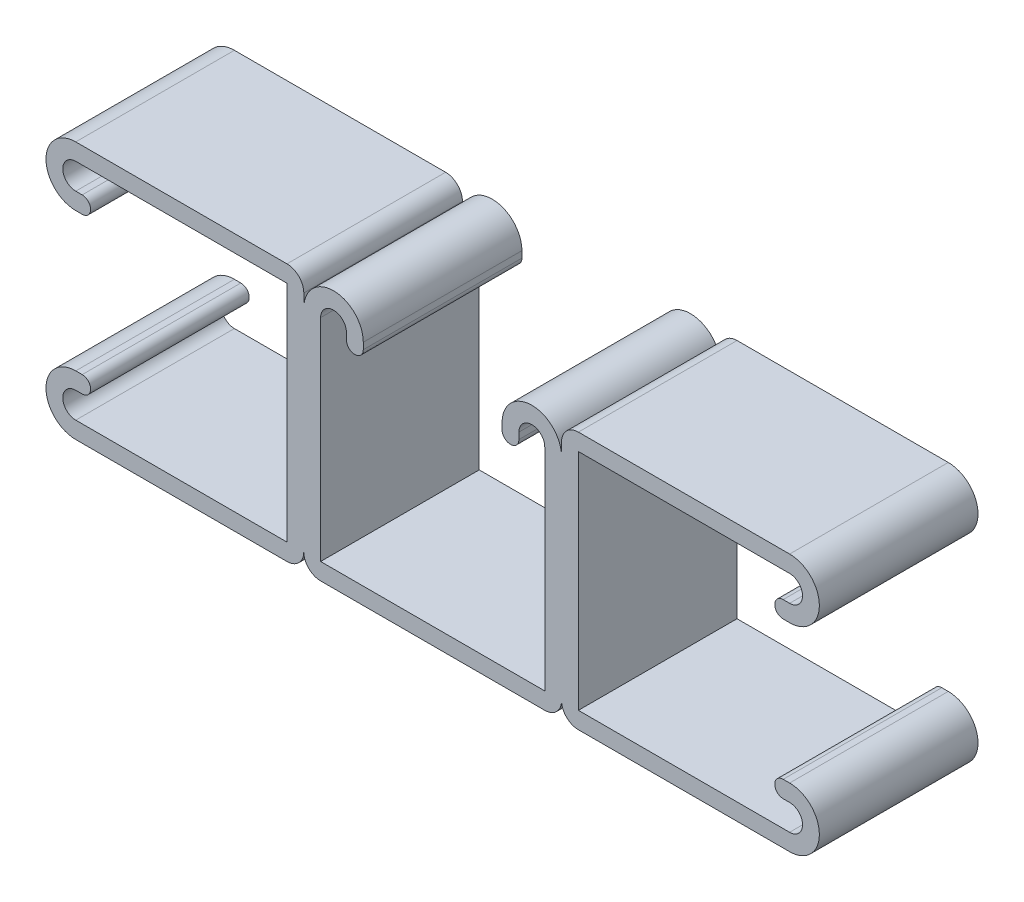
from build123d import *

# Parameters (mm, degrees)
BASE_EXTRUDE_DEPTH = 12.7
CIRPATTERN1_COUNT  = 2
CIRPATTERN1_ANGLE  = 90
CIRPATTERN2_COUNT  = 2
CIRPATTERN2_ANGLE  = 90


with BuildPart() as part:
    # Sketch1 → Base-Extrude (new, symmetric)
    with BuildSketch(Plane.XY):
        with BuildLine():
            Line((0, 36.5125), (0, 2.6924))
            ThreePointArc((0, 2.6924), (0.788585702, 0.788585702), (2.6924, 0))
            Line((2.6924, 0), (38.5826, 0))
            ThreePointArc((38.5826, 0), (40.486414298, 0.788585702), (41.275, 2.6924))
            Line((41.275, 2.6924), (41.275, 36.5125))
            ThreePointArc((41.275, 36.5125), (36.5125, 41.275), (31.75, 36.5125))
            Line((31.75, 36.5125), (31.75, 35.47745))
            ThreePointArc((31.75, 35.47745), (33.0962, 34.13125), (34.4424, 35.47745))
            Line((34.4424, 35.47745), (34.4424, 36.5125))
            ThreePointArc((34.4424, 36.5125), (36.5125, 38.5826), (38.5826, 36.5125))
            Line((38.5826, 36.5125), (38.5826, 2.6924))
            Line((38.5826, 2.6924), (2.6924, 2.6924))
            Line((2.6924, 2.6924), (2.6924, 36.5125))
            ThreePointArc((2.6924, 36.5125), (4.7625, 38.5826), (6.8326, 36.5125))
            Line((6.8326, 36.5125), (6.8326, 35.47745))
            ThreePointArc((6.8326, 35.47745), (8.1788, 34.13125), (9.525, 35.47745))
            Line((9.525, 35.47745), (9.525, 36.5125))
            ThreePointArc((9.525, 36.5125), (4.7625, 41.275), (0, 36.5125))
        make_face()
    base_extrude = extrude(amount=BASE_EXTRUDE_DEPTH, both=True)

    # CirPattern1: Base-Extrude ×2 about axis
    cirpattern1_axis = Axis((0, 0, 0), (0, 0, 1))
    for i in range(1, CIRPATTERN1_COUNT):
        add(base_extrude.rotate(cirpattern1_axis, i * CIRPATTERN1_ANGLE / (CIRPATTERN1_COUNT - 1)))

    # CirPattern2: Base-Extrude ×2 about axis
    cirpattern2_axis = Axis((41.275, 0, 0), (0, 0, -1))
    for i in range(1, CIRPATTERN2_COUNT):
        add(base_extrude.rotate(cirpattern2_axis, i * CIRPATTERN2_ANGLE / (CIRPATTERN2_COUNT - 1)))


solid = part.part
